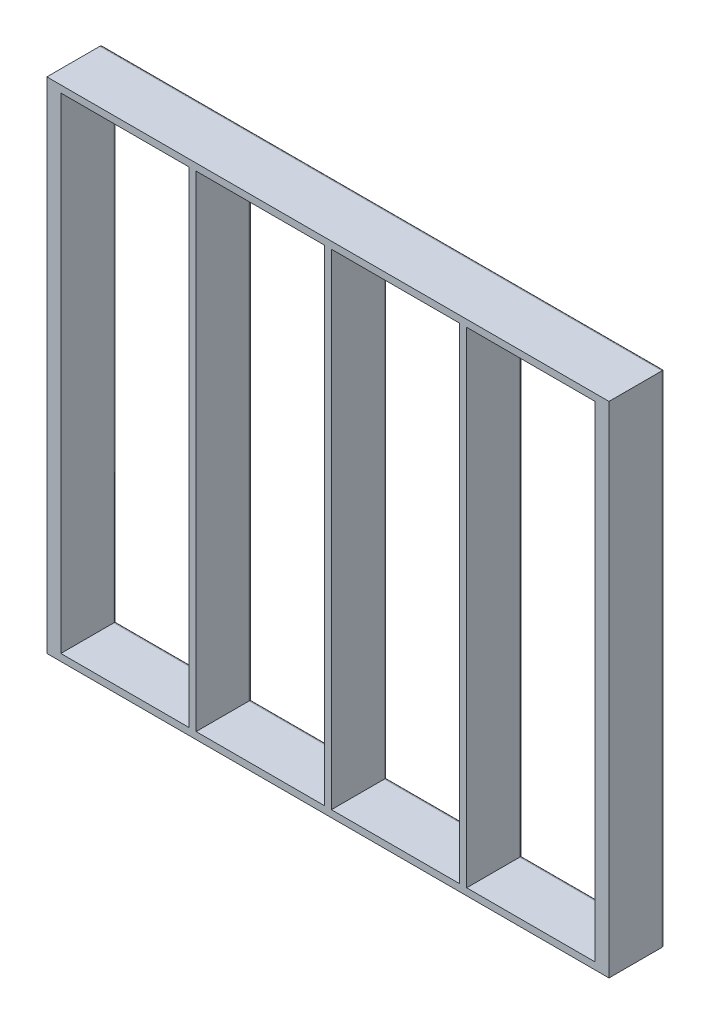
from build123d import *

# Parameters (mm, degrees)
SKETCH1_W           = 52.25
SKETCH1_H           = 179
SKETCH1_W_2         = 46
SKETCH1_H_2         = 174
SKETCH1_W_3         = 48.5
BOSS_EXTRUDE1_DEPTH = 20
FILLET4_R           = 1


with BuildPart() as part:
    # Sketch1 → Boss-Extrude1 (new body)
    # profile 1 of 4: a face of its own
    with BuildSketch(Plane.XY):
        with Locations((-1.875, 0)):
            Rectangle(SKETCH1_W, SKETCH1_H)
        Rectangle(SKETCH1_W_2, SKETCH1_H_2, mode=Mode.SUBTRACT)
    # profile 2 of 4: a face of its own
    with BuildSketch(Plane.XY):
        with Locations((48.5, 0)):
            Rectangle(SKETCH1_W_3, SKETCH1_H)
        with Locations((48.5, 0)):
            Rectangle(SKETCH1_W_2, SKETCH1_H_2, mode=Mode.SUBTRACT)
    # profile 3 of 4: a face of its own
    with BuildSketch(Plane.XY):
        with Locations((97, 0)):
            Rectangle(SKETCH1_W_3, SKETCH1_H)
        with Locations((97, 0)):
            Rectangle(SKETCH1_W_2, SKETCH1_H_2, mode=Mode.SUBTRACT)
    # profile 4 of 4: a face of its own
    with BuildSketch(Plane.XY):
        with Locations((147.375, 0)):
            Rectangle(SKETCH1_W, SKETCH1_H)
        with Locations((145.5, 0)):
            Rectangle(SKETCH1_W_2, SKETCH1_H_2, mode=Mode.SUBTRACT)
    extrude(amount=BOSS_EXTRUDE1_DEPTH)

    # Fillet4
    fillet4_edges = [part.edges().sort_by_distance(p)[0] for p in [
        (145.5, 87, 0),
        (122.5, 0, 0),
        (145.5, -87, 0),
        (168.5, 0, 0),
        (97, 87, 0),
        (74, 0, 0),
        (97, -87, 0),
        (120, 0, 0),
        (48.5, 87, 0),
        (25.5, 0, 0),
        (48.5, -87, 0),
        (71.5, 0, 0),
        (72.75, 89.5, 0),
        (173.5, 0, 0),
        (72.75, -89.5, 0),
        (-28, 0, 0),
        (0, 87, 0),
        (-23, 0, 0),
        (0, -87, 0),
        (23, 0, 0),
    ]]
    fillet(fillet4_edges, radius=FILLET4_R)


solid = part.part
